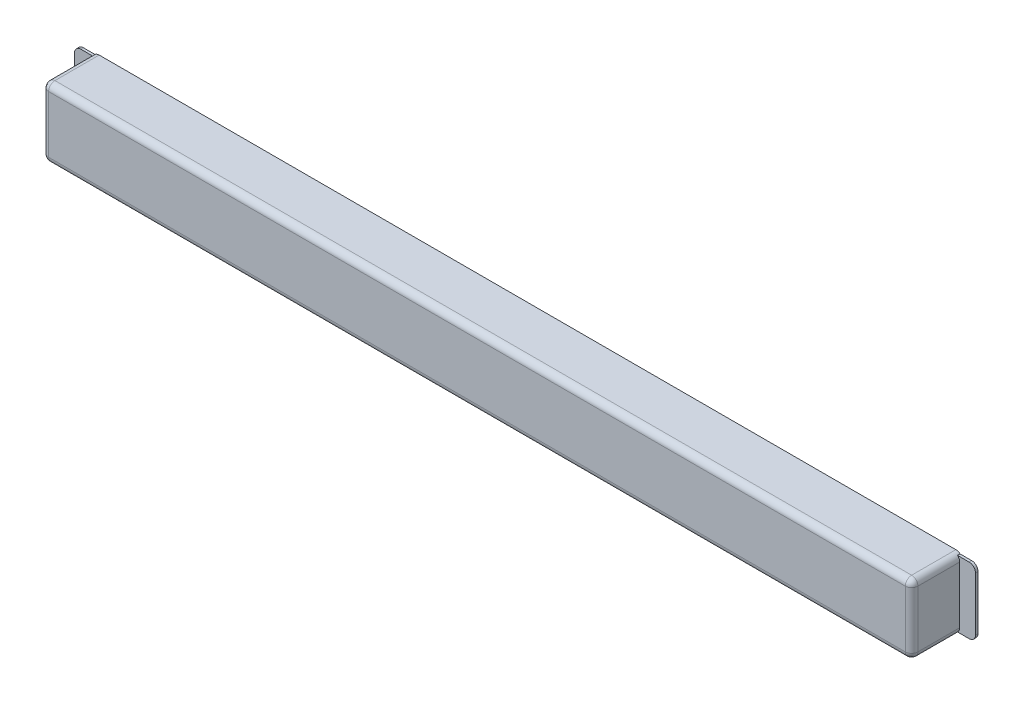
from build123d import *

# Parameters (mm, degrees)
SKETCH1_W            = 1375
SKETCH1_H            = 110
BOSS_EXTRUDE1_DEPTH  = 80
SKETCH2_W            = 50
SKETCH2_H            = 105
BOSS_EXTRUDE2_DEPTH  = 4
FILLET1_R            = 10
FILLET1_OF_MIRROR1_R = 10
FILLET2_R            = 10


with BuildPart() as part:
    # Sketch1 → Boss-Extrude1 (new body)
    with BuildSketch(Plane.XY):
        Rectangle(SKETCH1_W, SKETCH1_H)
    extrude(amount=BOSS_EXTRUDE1_DEPTH)

    # Sketch2 → Boss-Extrude2 (add)
    with BuildSketch(Plane(origin=(0, 0, 0), x_dir=(-1, 0, 0), z_dir=(0, 0, -1))):
        with Locations((-687.5, 0)):
            Rectangle(SKETCH2_W, SKETCH2_H)
    boss_extrude2 = extrude(amount=-BOSS_EXTRUDE2_DEPTH)

    # Fillet1
    fillet1_edges = [part.edges().sort_by_distance(p)[0] for p in [
        (712.5, 52.5, 2),
        (712.5, -52.5, 2),
    ]]
    fillet(fillet1_edges, radius=FILLET1_R)

    # Mirror1: Boss-Extrude2 across plane
    add(boss_extrude2.mirror(Plane(origin=(0, 0, 0), x_dir=(0, 0, 1), z_dir=(1, 0, 0))))

    # Fillet1 of Mirror1
    fillet1_of_mirror1_edges = [part.edges().sort_by_distance(p)[0] for p in [
        (-712.5, 52.5, 2),
        (-712.5, -52.5, 2),
    ]]
    fillet(fillet1_of_mirror1_edges, radius=FILLET1_OF_MIRROR1_R)

    # Fillet2
    fillet2_edges = [part.edges().sort_by_distance(p)[0] for p in [
        (0, -55, 80),
        (-687.5, 0, 80),
        (0, 55, 80),
        (687.5, 0, 80),
        (687.5, -55, 40),
        (687.5, 55, 40),
        (-687.5, -55, 40),
        (-687.5, 55, 40),
    ]]
    fillet(fillet2_edges, radius=FILLET2_R)


solid = part.part
